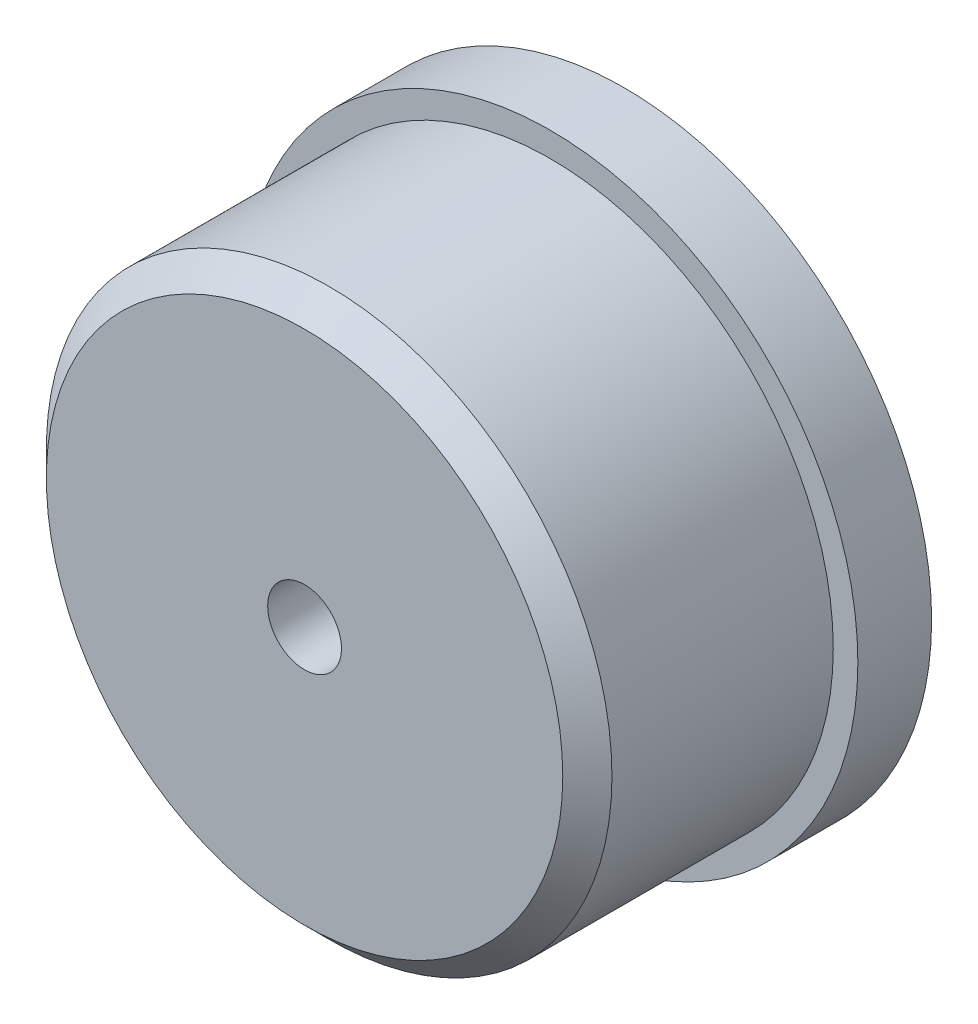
ISO-10303-21;
HEADER;
FILE_DESCRIPTION(('STEP AP214'),'2;1');
FILE_NAME('part.step','',(''),(''),'','','');
FILE_SCHEMA(('AUTOMOTIVE_DESIGN { 1 0 10303 214 1 1 1 1 }'));
ENDSEC;
DATA;
#1=APPLICATION_CONTEXT('core data for automotive mechanical design processes');
#2=APPLICATION_PROTOCOL_DEFINITION('international standard','automotive_design',2000,#1);
#3=PRODUCT_CONTEXT('',#1,'mechanical');
#4=PRODUCT('Part','Part','',(#3));
#5=PRODUCT_RELATED_PRODUCT_CATEGORY('part','',(#4));
#6=PRODUCT_DEFINITION_FORMATION('','',#4);
#7=PRODUCT_DEFINITION_CONTEXT('part definition',#1,'design');
#8=PRODUCT_DEFINITION('design','',#6,#7);
#9=PRODUCT_DEFINITION_SHAPE('','',#8);
#10=(LENGTH_UNIT() NAMED_UNIT(*) SI_UNIT(.MILLI.,.METRE.));
#11=(NAMED_UNIT(*) PLANE_ANGLE_UNIT() SI_UNIT($,.RADIAN.));
#12=(NAMED_UNIT(*) SI_UNIT($,.STERADIAN.) SOLID_ANGLE_UNIT());
#13=UNCERTAINTY_MEASURE_WITH_UNIT(LENGTH_MEASURE(1.E-05),#10,'distance_accuracy_value','');
#14=(GEOMETRIC_REPRESENTATION_CONTEXT(3) GLOBAL_UNCERTAINTY_ASSIGNED_CONTEXT((#13)) GLOBAL_UNIT_ASSIGNED_CONTEXT((#10,
#11,#12)) REPRESENTATION_CONTEXT('',''));
#15=CARTESIAN_POINT('',(0.,0.,0.));
#16=DIRECTION('',(0.,0.,1.));
#17=DIRECTION('',(1.,0.,0.));
#18=AXIS2_PLACEMENT_3D('',#15,#16,#17);
#19=CARTESIAN_POINT('',(0.,0.,3.));
#20=DIRECTION('',(0.,0.,1.));
#21=DIRECTION('',(1.,0.,0.));
#22=AXIS2_PLACEMENT_3D('',#19,#20,#21);
#23=PLANE('',#22);
#24=CARTESIAN_POINT('',(0.,0.,3.));
#25=DIRECTION('',(0.,0.,1.));
#26=DIRECTION('',(1.,0.,0.));
#27=AXIS2_PLACEMENT_3D('',#24,#25,#26);
#28=CIRCLE('',#27,12.5);
#29=CARTESIAN_POINT('',(12.5,0.,3.));
#30=VERTEX_POINT('',#29);
#31=EDGE_CURVE('E45',#30,#30,#28,.T.);
#32=ORIENTED_EDGE('',*,*,#31,.T.);
#33=EDGE_LOOP('',(#32));
#34=FACE_BOUND('',#33,.T.);
#35=CARTESIAN_POINT('',(0.,0.,3.));
#36=DIRECTION('',(0.,0.,1.));
#37=DIRECTION('',(1.,0.,0.));
#38=AXIS2_PLACEMENT_3D('',#35,#36,#37);
#39=CIRCLE('',#38,11.5);
#40=CARTESIAN_POINT('',(11.5,0.,3.));
#41=VERTEX_POINT('',#40);
#42=EDGE_CURVE('E54',#41,#41,#39,.T.);
#43=ORIENTED_EDGE('',*,*,#42,.F.);
#44=EDGE_LOOP('',(#43));
#45=FACE_BOUND('',#44,.T.);
#46=ADVANCED_FACE('F34',(#34,#45),#23,.T.);
#47=CARTESIAN_POINT('',(0.,0.,3.));
#48=DIRECTION('',(0.,0.,-1.));
#49=DIRECTION('',(-1.,0.,0.));
#50=AXIS2_PLACEMENT_3D('',#47,#48,#49);
#51=CYLINDRICAL_SURFACE('',#50,12.5);
#52=ORIENTED_EDGE('',*,*,#31,.F.);
#53=EDGE_LOOP('',(#52));
#54=FACE_BOUND('',#53,.T.);
#55=CARTESIAN_POINT('',(0.,0.,0.));
#56=DIRECTION('',(0.,0.,1.));
#57=DIRECTION('',(1.,0.,0.));
#58=AXIS2_PLACEMENT_3D('',#55,#56,#57);
#59=CIRCLE('',#58,12.5);
#60=CARTESIAN_POINT('',(12.5,0.,0.));
#61=VERTEX_POINT('',#60);
#62=EDGE_CURVE('E49',#61,#61,#59,.T.);
#63=ORIENTED_EDGE('',*,*,#62,.T.);
#64=EDGE_LOOP('',(#63));
#65=FACE_BOUND('',#64,.T.);
#66=ADVANCED_FACE('F36',(#54,#65),#51,.T.);
#67=CARTESIAN_POINT('',(0.,0.,0.));
#68=DIRECTION('',(0.,0.,1.));
#69=DIRECTION('',(1.,0.,0.));
#70=AXIS2_PLACEMENT_3D('',#67,#68,#69);
#71=PLANE('',#70);
#72=CARTESIAN_POINT('',(0.,0.,0.));
#73=DIRECTION('',(0.,0.,-1.));
#74=DIRECTION('',(-1.,0.,0.));
#75=AXIS2_PLACEMENT_3D('',#72,#73,#74);
#76=CIRCLE('',#75,1.49999999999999);
#77=CARTESIAN_POINT('',(-1.49999999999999,0.,0.));
#78=VERTEX_POINT('',#77);
#79=EDGE_CURVE('E57',#78,#78,#76,.T.);
#80=ORIENTED_EDGE('',*,*,#79,.F.);
#81=EDGE_LOOP('',(#80));
#82=FACE_BOUND('',#81,.T.);
#83=ORIENTED_EDGE('',*,*,#62,.F.);
#84=EDGE_LOOP('',(#83));
#85=FACE_BOUND('',#84,.T.);
#86=ADVANCED_FACE('F73',(#82,#85),#71,.F.);
#87=CARTESIAN_POINT('',(0.,0.,13.));
#88=DIRECTION('',(0.,0.,-1.));
#89=DIRECTION('',(-1.,0.,0.));
#90=AXIS2_PLACEMENT_3D('',#87,#88,#89);
#91=CYLINDRICAL_SURFACE('',#90,11.5);
#92=CARTESIAN_POINT('',(0.,0.,12.));
#93=DIRECTION('',(0.,0.,1.));
#94=DIRECTION('',(1.,0.,0.));
#95=AXIS2_PLACEMENT_3D('',#92,#93,#94);
#96=CIRCLE('',#95,11.5);
#97=CARTESIAN_POINT('',(11.5,0.,12.));
#98=VERTEX_POINT('',#97);
#99=EDGE_CURVE('E10',#98,#98,#96,.F.);
#100=ORIENTED_EDGE('',*,*,#99,.T.);
#101=EDGE_LOOP('',(#100));
#102=FACE_BOUND('',#101,.T.);
#103=ORIENTED_EDGE('',*,*,#42,.T.);
#104=EDGE_LOOP('',(#103));
#105=FACE_BOUND('',#104,.T.);
#106=ADVANCED_FACE('F76',(#102,#105),#91,.T.);
#107=CARTESIAN_POINT('',(0.,0.,13.));
#108=DIRECTION('',(0.,0.,1.));
#109=DIRECTION('',(1.,0.,0.));
#110=AXIS2_PLACEMENT_3D('',#107,#108,#109);
#111=PLANE('',#110);
#112=CARTESIAN_POINT('',(0.,0.,13.));
#113=DIRECTION('',(0.,0.,-1.));
#114=DIRECTION('',(-1.,0.,0.));
#115=AXIS2_PLACEMENT_3D('',#112,#113,#114);
#116=CIRCLE('',#115,1.5);
#117=CARTESIAN_POINT('',(-1.5,0.,13.));
#118=VERTEX_POINT('',#117);
#119=EDGE_CURVE('E60',#118,#118,#116,.T.);
#120=ORIENTED_EDGE('',*,*,#119,.T.);
#121=EDGE_LOOP('',(#120));
#122=FACE_BOUND('',#121,.T.);
#123=CARTESIAN_POINT('',(0.,0.,13.));
#124=DIRECTION('',(0.,0.,1.));
#125=DIRECTION('',(1.,0.,0.));
#126=AXIS2_PLACEMENT_3D('',#123,#124,#125);
#127=CIRCLE('',#126,10.5);
#128=CARTESIAN_POINT('',(10.5,0.,13.));
#129=VERTEX_POINT('',#128);
#130=EDGE_CURVE('E41',#129,#129,#127,.T.);
#131=ORIENTED_EDGE('',*,*,#130,.T.);
#132=EDGE_LOOP('',(#131));
#133=FACE_BOUND('',#132,.T.);
#134=ADVANCED_FACE('F64',(#122,#133),#111,.T.);
#135=CARTESIAN_POINT('',(0.,0.,13.));
#136=DIRECTION('',(0.,0.,-1.));
#137=DIRECTION('',(-1.,0.,0.));
#138=AXIS2_PLACEMENT_3D('',#135,#136,#137);
#139=CONICAL_SURFACE('',#138,10.5,0.785398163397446);
#140=ORIENTED_EDGE('',*,*,#99,.F.);
#141=EDGE_LOOP('',(#140));
#142=FACE_BOUND('',#141,.T.);
#143=ORIENTED_EDGE('',*,*,#130,.F.);
#144=EDGE_LOOP('',(#143));
#145=FACE_BOUND('',#144,.T.);
#146=ADVANCED_FACE('F69',(#142,#145),#139,.T.);
#147=CARTESIAN_POINT('',(0.,0.,0.));
#148=DIRECTION('',(0.,0.,-1.));
#149=DIRECTION('',(-1.,0.,0.));
#150=AXIS2_PLACEMENT_3D('',#147,#148,#149);
#151=CYLINDRICAL_SURFACE('',#150,1.49999999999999);
#152=ORIENTED_EDGE('',*,*,#119,.F.);
#153=EDGE_LOOP('',(#152));
#154=FACE_BOUND('',#153,.T.);
#155=ORIENTED_EDGE('',*,*,#79,.T.);
#156=EDGE_LOOP('',(#155));
#157=FACE_BOUND('',#156,.T.);
#158=ADVANCED_FACE('F66',(#154,#157),#151,.F.);
#159=CLOSED_SHELL('',(#46,#66,#86,#106,#134,#146,#158));
#160=MANIFOLD_SOLID_BREP('B2',#159);
#161=ADVANCED_BREP_SHAPE_REPRESENTATION('',(#18,#160),#14);
#162=SHAPE_DEFINITION_REPRESENTATION(#9,#161);
ENDSEC;
END-ISO-10303-21;
